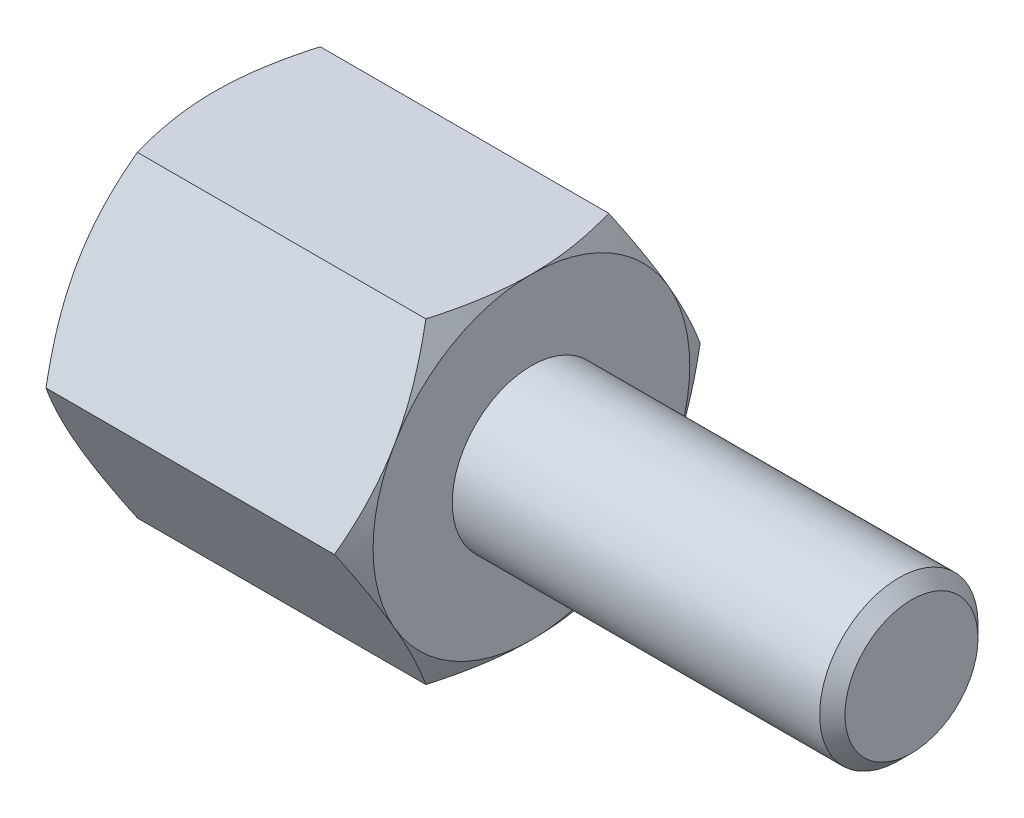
ISO-10303-21;
HEADER;
FILE_DESCRIPTION(('STEP AP214'),'2;1');
FILE_NAME('part.step','',(''),(''),'','','');
FILE_SCHEMA(('AUTOMOTIVE_DESIGN { 1 0 10303 214 1 1 1 1 }'));
ENDSEC;
DATA;
#1=APPLICATION_CONTEXT('core data for automotive mechanical design processes');
#2=APPLICATION_PROTOCOL_DEFINITION('international standard','automotive_design',2000,#1);
#3=PRODUCT_CONTEXT('',#1,'mechanical');
#4=PRODUCT('Part','Part','',(#3));
#5=PRODUCT_RELATED_PRODUCT_CATEGORY('part','',(#4));
#6=PRODUCT_DEFINITION_FORMATION('','',#4);
#7=PRODUCT_DEFINITION_CONTEXT('part definition',#1,'design');
#8=PRODUCT_DEFINITION('design','',#6,#7);
#9=PRODUCT_DEFINITION_SHAPE('','',#8);
#10=(LENGTH_UNIT() NAMED_UNIT(*) SI_UNIT(.MILLI.,.METRE.));
#11=(NAMED_UNIT(*) PLANE_ANGLE_UNIT() SI_UNIT($,.RADIAN.));
#12=(NAMED_UNIT(*) SI_UNIT($,.STERADIAN.) SOLID_ANGLE_UNIT());
#13=UNCERTAINTY_MEASURE_WITH_UNIT(LENGTH_MEASURE(1.E-05),#10,'distance_accuracy_value','');
#14=(GEOMETRIC_REPRESENTATION_CONTEXT(3) GLOBAL_UNCERTAINTY_ASSIGNED_CONTEXT((#13)) GLOBAL_UNIT_ASSIGNED_CONTEXT((#10,
#11,#12)) REPRESENTATION_CONTEXT('',''));
#15=CARTESIAN_POINT('',(0.,0.,0.));
#16=DIRECTION('',(0.,0.,1.));
#17=DIRECTION('',(1.,0.,0.));
#18=AXIS2_PLACEMENT_3D('',#15,#16,#17);
#19=CARTESIAN_POINT('',(2.5,2.5,-1.44337567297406));
#20=DIRECTION('',(1.,0.,0.));
#21=DIRECTION('',(0.,0.,-1.));
#22=AXIS2_PLACEMENT_3D('',#19,#20,#21);
#23=PLANE('',#22);
#24=CARTESIAN_POINT('',(2.5,0.,0.));
#25=DIRECTION('',(1.,0.,0.));
#26=DIRECTION('',(0.,0.,-1.));
#27=AXIS2_PLACEMENT_3D('',#24,#25,#26);
#28=CIRCLE('',#27,2.5);
#29=CARTESIAN_POINT('',(2.5,-1.25,-2.1650635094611));
#30=VERTEX_POINT('',#29);
#31=CARTESIAN_POINT('',(2.5,1.25,-2.1650635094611));
#32=VERTEX_POINT('',#31);
#33=EDGE_CURVE('E288',#30,#32,#28,.T.);
#34=ORIENTED_EDGE('',*,*,#33,.T.);
#35=CARTESIAN_POINT('',(2.5,2.5,0.));
#36=VERTEX_POINT('',#35);
#37=EDGE_CURVE('E53',#32,#36,#28,.T.);
#38=ORIENTED_EDGE('',*,*,#37,.T.);
#39=CARTESIAN_POINT('',(2.5,1.25,2.1650635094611));
#40=VERTEX_POINT('',#39);
#41=EDGE_CURVE('E296',#36,#40,#28,.T.);
#42=ORIENTED_EDGE('',*,*,#41,.T.);
#43=CARTESIAN_POINT('',(2.5,-1.25,2.1650635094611));
#44=VERTEX_POINT('',#43);
#45=EDGE_CURVE('E301',#40,#44,#28,.T.);
#46=ORIENTED_EDGE('',*,*,#45,.T.);
#47=CARTESIAN_POINT('',(2.5,0.,0.));
#48=DIRECTION('',(-1.,0.,0.));
#49=DIRECTION('',(0.,-1.,0.));
#50=AXIS2_PLACEMENT_3D('',#47,#48,#49);
#51=CIRCLE('',#50,2.5);
#52=CARTESIAN_POINT('',(2.5,-2.5,0.));
#53=VERTEX_POINT('',#52);
#54=EDGE_CURVE('E193',#53,#44,#51,.T.);
#55=ORIENTED_EDGE('',*,*,#54,.F.);
#56=EDGE_CURVE('E61',#53,#30,#28,.T.);
#57=ORIENTED_EDGE('',*,*,#56,.T.);
#58=EDGE_LOOP('',(#34,#38,#42,#46,#55,#57));
#59=FACE_BOUND('',#58,.T.);
#60=CARTESIAN_POINT('',(2.5,0.,0.));
#61=DIRECTION('',(1.,0.,0.));
#62=DIRECTION('',(0.,0.,-1.));
#63=AXIS2_PLACEMENT_3D('',#60,#61,#62);
#64=CIRCLE('',#63,1.25);
#65=CARTESIAN_POINT('',(2.5,0.,-1.25));
#66=VERTEX_POINT('',#65);
#67=EDGE_CURVE('E318',#66,#66,#64,.T.);
#68=ORIENTED_EDGE('',*,*,#67,.F.);
#69=EDGE_LOOP('',(#68));
#70=FACE_BOUND('',#69,.T.);
#71=ADVANCED_FACE('F37',(#59,#70),#23,.T.);
#72=CARTESIAN_POINT('',(2.5,0.,-2.88675134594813));
#73=DIRECTION('',(0.,-0.5,0.866025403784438));
#74=DIRECTION('',(0.,-0.866025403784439,-0.5));
#75=AXIS2_PLACEMENT_3D('',#72,#73,#74);
#76=PLANE('',#75);
#77=CARTESIAN_POINT('',(2.27664233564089,-0.000200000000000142,-2.88686681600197));
#78=CARTESIAN_POINT('',(2.31327837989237,0.109663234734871,-2.82343724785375));
#79=CARTESIAN_POINT('',(2.34659778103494,0.220474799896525,-2.75946016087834));
#80=CARTESIAN_POINT('',(2.40475771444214,0.444016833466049,-2.63039810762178));
#81=CARTESIAN_POINT('',(2.42957767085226,0.556751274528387,-2.5653108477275));
#82=CARTESIAN_POINT('',(2.46821434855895,0.780822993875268,-2.43594298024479));
#83=CARTESIAN_POINT('',(2.48228820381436,0.892125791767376,-2.37168227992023));
#84=CARTESIAN_POINT('',(2.49909084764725,1.11525522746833,-2.24285844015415));
#85=CARTESIAN_POINT('',(2.50183354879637,1.22708105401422,-2.17829576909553));
#86=CARTESIAN_POINT('',(2.49613423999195,1.43604197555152,-2.05765212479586));
#87=CARTESIAN_POINT('',(2.48909160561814,1.53320831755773,-2.0015531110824));
#88=CARTESIAN_POINT('',(2.46676858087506,1.726907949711,-1.88972057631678));
#89=CARTESIAN_POINT('',(2.45148056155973,1.82344056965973,-1.8339874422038));
#90=CARTESIAN_POINT('',(2.41326090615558,2.01753972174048,-1.7219242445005));
#91=CARTESIAN_POINT('',(2.39016722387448,2.11508168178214,-1.66560836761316));
#92=CARTESIAN_POINT('',(2.33775334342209,2.30871060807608,-1.55381665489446));
#93=CARTESIAN_POINT('',(2.30844546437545,2.40480005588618,-1.49833938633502));
#94=CARTESIAN_POINT('',(2.27664233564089,2.5002,-1.44326020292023));
#95=B_SPLINE_CURVE_WITH_KNOTS('',3,(#77,#78,#79,#80,#81,#82,#83,#84,#85,#86,#87,#88,#89,#90,#91,
#92,#93,#94),.UNSPECIFIED.,.F.,.F.,(4,2,2,2,2,2,2,2,4),(0.,0.396285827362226,0.79352433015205,
1.18093086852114,1.56786160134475,1.90479741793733,2.24204551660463,2.58677531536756,
2.93082800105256),.UNSPECIFIED.);
#96=CARTESIAN_POINT('',(2.2767090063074,0.,-2.88675134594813));
#97=VERTEX_POINT('',#96);
#98=EDGE_CURVE('E354',#97,#32,#95,.T.);
#99=ORIENTED_EDGE('',*,*,#98,.F.);
#100=DIRECTION('',(-1.,0.,0.));
#101=VECTOR('',#100,1.);
#102=CARTESIAN_POINT('',(2.5,0.,-2.88675134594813));
#103=LINE('',#102,#101);
#104=CARTESIAN_POINT('',(-2.2767090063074,0.,-2.88675134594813));
#105=VERTEX_POINT('',#104);
#106=EDGE_CURVE('E264',#97,#105,#103,.T.);
#107=ORIENTED_EDGE('',*,*,#106,.T.);
#108=CARTESIAN_POINT('',(-2.27664233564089,2.5002,-1.44326020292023));
#109=CARTESIAN_POINT('',(-2.31327837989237,2.39033676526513,-1.50668977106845));
#110=CARTESIAN_POINT('',(-2.34659778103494,2.27952520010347,-1.57066685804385));
#111=CARTESIAN_POINT('',(-2.40475771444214,2.05598316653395,-1.69972891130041));
#112=CARTESIAN_POINT('',(-2.42957767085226,1.94324872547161,-1.7648161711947));
#113=CARTESIAN_POINT('',(-2.46821434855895,1.71917700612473,-1.8941840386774));
#114=CARTESIAN_POINT('',(-2.48228820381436,1.60787420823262,-1.95844473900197));
#115=CARTESIAN_POINT('',(-2.49909084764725,1.38474477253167,-2.08726857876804));
#116=CARTESIAN_POINT('',(-2.50183354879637,1.27291894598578,-2.15183124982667));
#117=CARTESIAN_POINT('',(-2.49613423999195,1.06395802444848,-2.27247489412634));
#118=CARTESIAN_POINT('',(-2.48909160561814,0.966791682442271,-2.32857390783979));
#119=CARTESIAN_POINT('',(-2.46676858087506,0.773092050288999,-2.44040644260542));
#120=CARTESIAN_POINT('',(-2.45148056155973,0.676559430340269,-2.49613957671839));
#121=CARTESIAN_POINT('',(-2.41326090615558,0.482460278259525,-2.60820277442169));
#122=CARTESIAN_POINT('',(-2.39016722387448,0.38491831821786,-2.66451865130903));
#123=CARTESIAN_POINT('',(-2.33775334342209,0.191289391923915,-2.77631036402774));
#124=CARTESIAN_POINT('',(-2.30844546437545,0.0951999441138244,-2.83178763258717));
#125=CARTESIAN_POINT('',(-2.27664233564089,-0.000199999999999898,-2.88686681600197));
#126=B_SPLINE_CURVE_WITH_KNOTS('',3,(#108,#109,#110,#111,#112,#113,#114,#115,#116,#117,#118,
#119,#120,#121,#122,#123,#124,#125),.UNSPECIFIED.,.F.,.F.,(4,2,2,2,2,2,2,2,4),(0.,
0.396285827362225,0.793524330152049,1.18093086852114,1.56786160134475,1.90479741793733,
2.24204551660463,2.58677531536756,2.93082800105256),.UNSPECIFIED.);
#127=CARTESIAN_POINT('',(-2.5,1.25,-2.1650635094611));
#128=VERTEX_POINT('',#127);
#129=EDGE_CURVE('E382',#128,#105,#126,.T.);
#130=ORIENTED_EDGE('',*,*,#129,.F.);
#131=CARTESIAN_POINT('',(-2.2767090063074,2.5,-1.44337567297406));
#132=VERTEX_POINT('',#131);
#133=EDGE_CURVE('E380',#132,#128,#126,.T.);
#134=ORIENTED_EDGE('',*,*,#133,.F.);
#135=DIRECTION('',(-1.,0.,0.));
#136=VECTOR('',#135,1.);
#137=CARTESIAN_POINT('',(2.5,2.5,-1.44337567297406));
#138=LINE('',#137,#136);
#139=CARTESIAN_POINT('',(2.27670900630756,2.5,-1.44337567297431));
#140=VERTEX_POINT('',#139);
#141=EDGE_CURVE('E279',#140,#132,#138,.T.);
#142=ORIENTED_EDGE('',*,*,#141,.F.);
#143=EDGE_CURVE('E229',#32,#140,#95,.T.);
#144=ORIENTED_EDGE('',*,*,#143,.F.);
#145=EDGE_LOOP('',(#99,#107,#130,#134,#142,#144));
#146=FACE_BOUND('',#145,.T.);
#147=ADVANCED_FACE('F148',(#146),#76,.F.);
#148=CARTESIAN_POINT('',(2.5,2.5,-1.44337567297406));
#149=DIRECTION('',(0.,-1.,0.));
#150=DIRECTION('',(0.,0.,-1.));
#151=AXIS2_PLACEMENT_3D('',#148,#149,#150);
#152=PLANE('',#151);
#153=CARTESIAN_POINT('',(1.26803388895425,2.5,-3.90158441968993));
#154=CARTESIAN_POINT('',(1.32120772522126,2.5,-3.79217004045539));
#155=CARTESIAN_POINT('',(1.37387869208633,2.5,-3.68250707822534));
#156=CARTESIAN_POINT('',(1.47793249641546,2.5,-3.46255185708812));
#157=CARTESIAN_POINT('',(1.52931513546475,2.5,-3.35225950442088));
#158=CARTESIAN_POINT('',(1.63076309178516,2.5,-3.130356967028));
#159=CARTESIAN_POINT('',(1.68081992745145,2.5,-3.01874289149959));
#160=CARTESIAN_POINT('',(1.77891712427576,2.5,-2.79463535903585));
#161=CARTESIAN_POINT('',(1.82695757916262,2.5,-2.68214194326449));
#162=CARTESIAN_POINT('',(1.92201845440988,2.5,-2.45240385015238));
#163=CARTESIAN_POINT('',(1.96895431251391,2.5,-2.33512399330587));
#164=CARTESIAN_POINT('',(2.05933269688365,2.5,-2.09920133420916));
#165=CARTESIAN_POINT('',(2.10277483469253,2.5,-1.98055838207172));
#166=CARTESIAN_POINT('',(2.18504351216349,2.5,-1.74193489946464));
#167=CARTESIAN_POINT('',(2.22387917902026,2.5,-1.6219575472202));
#168=CARTESIAN_POINT('',(2.29570507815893,2.5,-1.38028205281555));
#169=CARTESIAN_POINT('',(2.32869712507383,2.5,-1.25858445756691));
#170=CARTESIAN_POINT('',(2.38709594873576,2.5,-1.01406369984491));
#171=CARTESIAN_POINT('',(2.4125437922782,2.5,-0.891250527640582));
#172=CARTESIAN_POINT('',(2.45442751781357,2.5,-0.644071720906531));
#173=CARTESIAN_POINT('',(2.47086432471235,2.5,-0.519706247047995));
#174=CARTESIAN_POINT('',(2.4932006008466,2.5,-0.27167920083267));
#175=CARTESIAN_POINT('',(2.49923751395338,2.5,-0.148030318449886));
#176=CARTESIAN_POINT('',(2.50062561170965,2.5,0.0993395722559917));
#177=CARTESIAN_POINT('',(2.49597656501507,2.5,0.223060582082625));
#178=CARTESIAN_POINT('',(2.47940443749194,2.5,0.4323517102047));
#179=CARTESIAN_POINT('',(2.47010665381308,2.5,0.518143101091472));
#180=CARTESIAN_POINT('',(2.44693847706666,2.5,0.689112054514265));
#181=CARTESIAN_POINT('',(2.43306748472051,2.5,0.774289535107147));
#182=CARTESIAN_POINT('',(2.38532020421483,2.5,1.02876599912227));
#183=CARTESIAN_POINT('',(2.34531764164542,2.5,1.19691958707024));
#184=CARTESIAN_POINT('',(2.25226567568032,2.5,1.53362893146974));
#185=CARTESIAN_POINT('',(2.19893620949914,2.5,1.70210423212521));
#186=CARTESIAN_POINT('',(2.11237169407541,2.5,1.95247339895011));
#187=CARTESIAN_POINT('',(2.08242477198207,2.5,2.03553184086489));
#188=CARTESIAN_POINT('',(2.02068409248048,2.5,2.20095860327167));
#189=CARTESIAN_POINT('',(1.98889037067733,2.5,2.2833269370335));
#190=CARTESIAN_POINT('',(1.90401426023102,2.5,2.49723312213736));
#191=CARTESIAN_POINT('',(1.84971733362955,2.5,2.6282879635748));
#192=CARTESIAN_POINT('',(1.73812739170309,2.5,2.88912034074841));
#193=CARTESIAN_POINT('',(1.6808341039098,2.5,3.01889775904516));
#194=CARTESIAN_POINT('',(1.56393487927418,2.5,3.27745045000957));
#195=CARTESIAN_POINT('',(1.50432825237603,2.5,3.40622540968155));
#196=CARTESIAN_POINT('',(1.38332345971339,2.5,3.66293235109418));
#197=CARTESIAN_POINT('',(1.32192524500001,2.5,3.79086430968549));
#198=CARTESIAN_POINT('',(1.1354580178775,2.5,4.17399495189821));
#199=CARTESIAN_POINT('',(1.00828249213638,2.5,4.42816724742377));
#200=CARTESIAN_POINT('',(0.750345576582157,2.5,4.93461464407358));
#201=CARTESIAN_POINT('',(0.619584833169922,2.5,5.18689007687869));
#202=CARTESIAN_POINT('',(0.368710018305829,2.5,5.66512451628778));
#203=CARTESIAN_POINT('',(0.248829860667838,2.5,5.89120644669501));
#204=CARTESIAN_POINT('',(0.00759021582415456,2.5,6.34259369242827));
#205=CARTESIAN_POINT('',(-0.113769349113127,2.5,6.56789896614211));
#206=CARTESIAN_POINT('',(-0.357219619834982,2.5,7.01722044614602));
#207=CARTESIAN_POINT('',(-0.479306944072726,2.5,7.24123848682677));
#208=CARTESIAN_POINT('',(-0.724333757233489,2.5,7.68878772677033));
#209=CARTESIAN_POINT('',(-0.847273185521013,2.5,7.9123189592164));
#210=CARTESIAN_POINT('',(-0.970524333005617,2.5,8.13567697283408));
#211=B_SPLINE_CURVE_WITH_KNOTS('',3,(#153,#154,#155,#156,#157,#158,#159,#160,#161,#162,#163,
#164,#165,#166,#167,#168,#169,#170,#171,#172,#173,#174,#175,#176,#177,#178,#179,#180,#181,#182,
#183,#184,#185,#186,#187,#188,#189,#190,#191,#192,#193,#194,#195,#196,#197,#198,#199,#200,#201,
#202,#203,#204,#205,#206,#207,#208,#209,#210),.UNSPECIFIED.,.F.,.F.,(4,2,2,2,2,2,2,2,2,2,2,2,2,
2,2,2,2,2,2,2,2,2,2,2,2,2,2,2,4),(0.,0.364957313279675,0.729970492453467,1.09692930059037,
1.46387103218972,1.84279746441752,2.22176597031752,2.59997058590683,2.97805755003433,
3.35404692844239,3.72999770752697,4.10094071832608,4.47189175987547,4.73064905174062,
4.98944026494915,5.50729076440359,6.03710483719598,6.30196454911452,6.56681915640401,
6.99233818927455,7.41789598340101,7.84358170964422,8.26927907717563,9.12186602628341,
9.97430025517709,10.7419897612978,11.5097197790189,12.2750964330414,13.0404191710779),.UNSPECIFIED.);
#212=EDGE_CURVE('E227',#140,#36,#211,.T.);
#213=ORIENTED_EDGE('',*,*,#212,.F.);
#214=ORIENTED_EDGE('',*,*,#141,.T.);
#215=CARTESIAN_POINT('',(-1.26803388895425,2.5,-3.90158441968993));
#216=CARTESIAN_POINT('',(-1.32120772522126,2.5,-3.79217004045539));
#217=CARTESIAN_POINT('',(-1.37387869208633,2.5,-3.68250707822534));
#218=CARTESIAN_POINT('',(-1.47793249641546,2.5,-3.46255185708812));
#219=CARTESIAN_POINT('',(-1.52931513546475,2.5,-3.35225950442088));
#220=CARTESIAN_POINT('',(-1.63076309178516,2.5,-3.130356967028));
#221=CARTESIAN_POINT('',(-1.68081992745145,2.5,-3.01874289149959));
#222=CARTESIAN_POINT('',(-1.77891712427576,2.5,-2.79463535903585));
#223=CARTESIAN_POINT('',(-1.82695757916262,2.5,-2.68214194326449));
#224=CARTESIAN_POINT('',(-1.92201845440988,2.5,-2.45240385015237));
#225=CARTESIAN_POINT('',(-1.96895431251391,2.5,-2.33512399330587));
#226=CARTESIAN_POINT('',(-2.05933269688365,2.5,-2.09920133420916));
#227=CARTESIAN_POINT('',(-2.10277483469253,2.5,-1.98055838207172));
#228=CARTESIAN_POINT('',(-2.18504351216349,2.5,-1.74193489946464));
#229=CARTESIAN_POINT('',(-2.22387917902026,2.5,-1.6219575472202));
#230=CARTESIAN_POINT('',(-2.29570507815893,2.5,-1.38028205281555));
#231=CARTESIAN_POINT('',(-2.32869712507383,2.5,-1.25858445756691));
#232=CARTESIAN_POINT('',(-2.38709594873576,2.5,-1.01406369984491));
#233=CARTESIAN_POINT('',(-2.4125437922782,2.5,-0.891250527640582));
#234=CARTESIAN_POINT('',(-2.45442751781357,2.5,-0.644071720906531));
#235=CARTESIAN_POINT('',(-2.47086432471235,2.5,-0.519706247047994));
#236=CARTESIAN_POINT('',(-2.4932006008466,2.5,-0.27167920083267));
#237=CARTESIAN_POINT('',(-2.49923751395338,2.5,-0.148030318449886));
#238=CARTESIAN_POINT('',(-2.50062561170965,2.5,0.099339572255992));
#239=CARTESIAN_POINT('',(-2.49597656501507,2.5,0.223060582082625));
#240=CARTESIAN_POINT('',(-2.47940443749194,2.5,0.4323517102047));
#241=CARTESIAN_POINT('',(-2.47010665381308,2.5,0.518143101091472));
#242=CARTESIAN_POINT('',(-2.44693847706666,2.5,0.689112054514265));
#243=CARTESIAN_POINT('',(-2.43306748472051,2.5,0.774289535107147));
#244=CARTESIAN_POINT('',(-2.38532020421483,2.5,1.02876599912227));
#245=CARTESIAN_POINT('',(-2.34531764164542,2.5,1.19691958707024));
#246=CARTESIAN_POINT('',(-2.25226567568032,2.5,1.53362893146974));
#247=CARTESIAN_POINT('',(-2.19893620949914,2.5,1.70210423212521));
#248=CARTESIAN_POINT('',(-2.11237169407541,2.5,1.95247339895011));
#249=CARTESIAN_POINT('',(-2.08242477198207,2.5,2.03553184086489));
#250=CARTESIAN_POINT('',(-2.02068409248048,2.5,2.20095860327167));
#251=CARTESIAN_POINT('',(-1.98889037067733,2.5,2.2833269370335));
#252=CARTESIAN_POINT('',(-1.90401426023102,2.5,2.49723312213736));
#253=CARTESIAN_POINT('',(-1.84971733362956,2.5,2.6282879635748));
#254=CARTESIAN_POINT('',(-1.7381273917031,2.5,2.8891203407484));
#255=CARTESIAN_POINT('',(-1.6808341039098,2.5,3.01889775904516));
#256=CARTESIAN_POINT('',(-1.56393487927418,2.5,3.27745045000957));
#257=CARTESIAN_POINT('',(-1.50432825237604,2.5,3.40622540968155));
#258=CARTESIAN_POINT('',(-1.3833234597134,2.5,3.66293235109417));
#259=CARTESIAN_POINT('',(-1.32192524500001,2.5,3.79086430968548));
#260=CARTESIAN_POINT('',(-1.1354580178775,2.5,4.1739949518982));
#261=CARTESIAN_POINT('',(-1.00828249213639,2.5,4.42816724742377));
#262=CARTESIAN_POINT('',(-0.75034557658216,2.5,4.93461464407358));
#263=CARTESIAN_POINT('',(-0.619584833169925,2.5,5.18689007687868));
#264=CARTESIAN_POINT('',(-0.368710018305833,2.5,5.66512451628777));
#265=CARTESIAN_POINT('',(-0.248829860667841,2.5,5.891206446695));
#266=CARTESIAN_POINT('',(-0.00759021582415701,2.5,6.34259369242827));
#267=CARTESIAN_POINT('',(0.113769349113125,2.5,6.5678989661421));
#268=CARTESIAN_POINT('',(0.357219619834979,2.5,7.01722044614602));
#269=CARTESIAN_POINT('',(0.479306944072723,2.5,7.24123848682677));
#270=CARTESIAN_POINT('',(0.724333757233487,2.5,7.68878772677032));
#271=CARTESIAN_POINT('',(0.847273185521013,2.5,7.9123189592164));
#272=CARTESIAN_POINT('',(0.970524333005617,2.5,8.13567697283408));
#273=B_SPLINE_CURVE_WITH_KNOTS('',3,(#215,#216,#217,#218,#219,#220,#221,#222,#223,#224,#225,
#226,#227,#228,#229,#230,#231,#232,#233,#234,#235,#236,#237,#238,#239,#240,#241,#242,#243,#244,
#245,#246,#247,#248,#249,#250,#251,#252,#253,#254,#255,#256,#257,#258,#259,#260,#261,#262,#263,
#264,#265,#266,#267,#268,#269,#270,#271,#272),.UNSPECIFIED.,.F.,.F.,(4,2,2,2,2,2,2,2,2,2,2,2,2,
2,2,2,2,2,2,2,2,2,2,2,2,2,2,2,4),(0.,0.364957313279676,0.729970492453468,1.09692930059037,
1.46387103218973,1.84279746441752,2.22176597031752,2.59997058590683,2.97805755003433,
3.35404692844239,3.72999770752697,4.10094071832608,4.47189175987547,4.73064905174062,
4.98944026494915,5.5072907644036,6.03710483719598,6.30196454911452,6.56681915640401,
6.99233818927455,7.41789598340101,7.84358170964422,8.26927907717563,9.12186602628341,
9.97430025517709,10.7419897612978,11.5097197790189,12.2750964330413,13.0404191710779),.UNSPECIFIED.);
#274=CARTESIAN_POINT('',(-2.5,2.5,0.));
#275=VERTEX_POINT('',#274);
#276=EDGE_CURVE('E241',#275,#132,#273,.F.);
#277=ORIENTED_EDGE('',*,*,#276,.F.);
#278=CARTESIAN_POINT('',(-2.2767090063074,2.5,1.44337567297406));
#279=VERTEX_POINT('',#278);
#280=EDGE_CURVE('E249',#279,#275,#273,.F.);
#281=ORIENTED_EDGE('',*,*,#280,.F.);
#282=DIRECTION('',(-1.,0.,0.));
#283=VECTOR('',#282,1.);
#284=CARTESIAN_POINT('',(2.5,2.5,1.44337567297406));
#285=LINE('',#284,#283);
#286=CARTESIAN_POINT('',(2.2767090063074,2.5,1.44337567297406));
#287=VERTEX_POINT('',#286);
#288=EDGE_CURVE('E276',#287,#279,#285,.T.);
#289=ORIENTED_EDGE('',*,*,#288,.F.);
#290=EDGE_CURVE('E221',#36,#287,#211,.T.);
#291=ORIENTED_EDGE('',*,*,#290,.F.);
#292=EDGE_LOOP('',(#213,#214,#277,#281,#289,#291));
#293=FACE_BOUND('',#292,.T.);
#294=ADVANCED_FACE('F153',(#293),#152,.F.);
#295=CARTESIAN_POINT('',(2.5,2.5,1.44337567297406));
#296=DIRECTION('',(0.,-0.5,-0.866025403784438));
#297=DIRECTION('',(0.,0.866025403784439,-0.5));
#298=AXIS2_PLACEMENT_3D('',#295,#296,#297);
#299=PLANE('',#298);
#300=CARTESIAN_POINT('',(2.27664233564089,2.5002,1.44326020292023));
#301=CARTESIAN_POINT('',(2.31327837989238,2.39033676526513,1.50668977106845));
#302=CARTESIAN_POINT('',(2.34659778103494,2.27952520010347,1.57066685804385));
#303=CARTESIAN_POINT('',(2.40475771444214,2.05598316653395,1.69972891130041));
#304=CARTESIAN_POINT('',(2.42957767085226,1.94324872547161,1.7648161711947));
#305=CARTESIAN_POINT('',(2.46821434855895,1.71917700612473,1.8941840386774));
#306=CARTESIAN_POINT('',(2.48228820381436,1.60787420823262,1.95844473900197));
#307=CARTESIAN_POINT('',(2.49909084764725,1.38474477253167,2.08726857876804));
#308=CARTESIAN_POINT('',(2.50183354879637,1.27291894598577,2.15183124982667));
#309=CARTESIAN_POINT('',(2.49613423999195,1.06395802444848,2.27247489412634));
#310=CARTESIAN_POINT('',(2.48909160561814,0.96679168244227,2.32857390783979));
#311=CARTESIAN_POINT('',(2.46676858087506,0.773092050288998,2.44040644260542));
#312=CARTESIAN_POINT('',(2.45148056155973,0.676559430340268,2.49613957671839));
#313=CARTESIAN_POINT('',(2.41326090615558,0.482460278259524,2.60820277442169));
#314=CARTESIAN_POINT('',(2.39016722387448,0.38491831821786,2.66451865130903));
#315=CARTESIAN_POINT('',(2.33775334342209,0.191289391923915,2.77631036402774));
#316=CARTESIAN_POINT('',(2.30844546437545,0.0951999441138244,2.83178763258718));
#317=CARTESIAN_POINT('',(2.27664233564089,-0.000199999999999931,2.88686681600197));
#318=B_SPLINE_CURVE_WITH_KNOTS('',3,(#300,#301,#302,#303,#304,#305,#306,#307,#308,#309,#310,
#311,#312,#313,#314,#315,#316,#317),.UNSPECIFIED.,.F.,.F.,(4,2,2,2,2,2,2,2,4),(0.,
0.396285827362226,0.793524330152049,1.18093086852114,1.56786160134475,1.90479741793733,
2.24204551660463,2.58677531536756,2.93082800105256),.UNSPECIFIED.);
#319=EDGE_CURVE('E228',#287,#40,#318,.T.);
#320=ORIENTED_EDGE('',*,*,#319,.F.);
#321=ORIENTED_EDGE('',*,*,#288,.T.);
#322=CARTESIAN_POINT('',(-2.27664233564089,-0.000199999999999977,2.88686681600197));
#323=CARTESIAN_POINT('',(-2.31327837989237,0.109663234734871,2.82343724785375));
#324=CARTESIAN_POINT('',(-2.34659778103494,0.220474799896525,2.75946016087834));
#325=CARTESIAN_POINT('',(-2.40475771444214,0.444016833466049,2.63039810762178));
#326=CARTESIAN_POINT('',(-2.42957767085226,0.556751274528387,2.5653108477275));
#327=CARTESIAN_POINT('',(-2.46821434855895,0.780822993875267,2.43594298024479));
#328=CARTESIAN_POINT('',(-2.48228820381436,0.892125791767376,2.37168227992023));
#329=CARTESIAN_POINT('',(-2.49909084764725,1.11525522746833,2.24285844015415));
#330=CARTESIAN_POINT('',(-2.50183354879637,1.22708105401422,2.17829576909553));
#331=CARTESIAN_POINT('',(-2.49613423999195,1.43604197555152,2.05765212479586));
#332=CARTESIAN_POINT('',(-2.48909160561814,1.53320831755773,2.0015531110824));
#333=CARTESIAN_POINT('',(-2.46676858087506,1.726907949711,1.88972057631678));
#334=CARTESIAN_POINT('',(-2.45148056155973,1.82344056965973,1.8339874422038));
#335=CARTESIAN_POINT('',(-2.41326090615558,2.01753972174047,1.7219242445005));
#336=CARTESIAN_POINT('',(-2.39016722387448,2.11508168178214,1.66560836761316));
#337=CARTESIAN_POINT('',(-2.33775334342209,2.30871060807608,1.55381665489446));
#338=CARTESIAN_POINT('',(-2.30844546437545,2.40480005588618,1.49833938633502));
#339=CARTESIAN_POINT('',(-2.27664233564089,2.5002,1.44326020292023));
#340=B_SPLINE_CURVE_WITH_KNOTS('',3,(#322,#323,#324,#325,#326,#327,#328,#329,#330,#331,#332,
#333,#334,#335,#336,#337,#338,#339),.UNSPECIFIED.,.F.,.F.,(4,2,2,2,2,2,2,2,4),(0.,
0.396285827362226,0.793524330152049,1.18093086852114,1.56786160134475,1.90479741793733,
2.24204551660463,2.58677531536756,2.93082800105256),.UNSPECIFIED.);
#341=CARTESIAN_POINT('',(-2.5,1.25,2.1650635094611));
#342=VERTEX_POINT('',#341);
#343=EDGE_CURVE('E255',#342,#279,#340,.T.);
#344=ORIENTED_EDGE('',*,*,#343,.F.);
#345=CARTESIAN_POINT('',(-2.2767090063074,0.,2.88675134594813));
#346=VERTEX_POINT('',#345);
#347=EDGE_CURVE('E262',#346,#342,#340,.T.);
#348=ORIENTED_EDGE('',*,*,#347,.F.);
#349=DIRECTION('',(-1.,0.,0.));
#350=VECTOR('',#349,1.);
#351=CARTESIAN_POINT('',(2.5,0.,2.88675134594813));
#352=LINE('',#351,#350);
#353=CARTESIAN_POINT('',(2.2767090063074,0.,2.88675134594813));
#354=VERTEX_POINT('',#353);
#355=EDGE_CURVE('E273',#354,#346,#352,.T.);
#356=ORIENTED_EDGE('',*,*,#355,.F.);
#357=EDGE_CURVE('E215',#40,#354,#318,.T.);
#358=ORIENTED_EDGE('',*,*,#357,.F.);
#359=EDGE_LOOP('',(#320,#321,#344,#348,#356,#358));
#360=FACE_BOUND('',#359,.T.);
#361=ADVANCED_FACE('F235',(#360),#299,.F.);
#362=CARTESIAN_POINT('',(2.5,0.,2.88675134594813));
#363=DIRECTION('',(0.,0.5,-0.866025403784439));
#364=DIRECTION('',(0.,0.866025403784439,0.5));
#365=AXIS2_PLACEMENT_3D('',#362,#363,#364);
#366=PLANE('',#365);
#367=CARTESIAN_POINT('',(2.27664233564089,0.00020000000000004,2.88686681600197));
#368=CARTESIAN_POINT('',(2.31327837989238,-0.109663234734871,2.82343724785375));
#369=CARTESIAN_POINT('',(2.34659778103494,-0.220474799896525,2.75946016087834));
#370=CARTESIAN_POINT('',(2.40475771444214,-0.444016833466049,2.63039810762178));
#371=CARTESIAN_POINT('',(2.42957767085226,-0.556751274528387,2.5653108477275));
#372=CARTESIAN_POINT('',(2.46821434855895,-0.780822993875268,2.43594298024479));
#373=CARTESIAN_POINT('',(2.48228820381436,-0.892125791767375,2.37168227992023));
#374=CARTESIAN_POINT('',(2.49909084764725,-1.11525522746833,2.24285844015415));
#375=CARTESIAN_POINT('',(2.50183354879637,-1.22708105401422,2.17829576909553));
#376=CARTESIAN_POINT('',(2.49613423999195,-1.43604197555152,2.05765212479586));
#377=CARTESIAN_POINT('',(2.48909160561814,-1.53320831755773,2.0015531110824));
#378=CARTESIAN_POINT('',(2.46676858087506,-1.726907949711,1.88972057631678));
#379=CARTESIAN_POINT('',(2.45148056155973,-1.82344056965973,1.8339874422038));
#380=CARTESIAN_POINT('',(2.41326090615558,-2.01753972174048,1.7219242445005));
#381=CARTESIAN_POINT('',(2.39016722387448,-2.11508168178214,1.66560836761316));
#382=CARTESIAN_POINT('',(2.33775334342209,-2.30871060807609,1.55381665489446));
#383=CARTESIAN_POINT('',(2.30844546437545,-2.40480005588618,1.49833938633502));
#384=CARTESIAN_POINT('',(2.27664233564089,-2.5002,1.44326020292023));
#385=B_SPLINE_CURVE_WITH_KNOTS('',3,(#367,#368,#369,#370,#371,#372,#373,#374,#375,#376,#377,
#378,#379,#380,#381,#382,#383,#384),.UNSPECIFIED.,.F.,.F.,(4,2,2,2,2,2,2,2,4),(0.,
0.396285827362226,0.793524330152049,1.18093086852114,1.56786160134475,1.90479741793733,
2.24204551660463,2.58677531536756,2.93082800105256),.UNSPECIFIED.);
#386=EDGE_CURVE('E317',#354,#44,#385,.T.);
#387=ORIENTED_EDGE('',*,*,#386,.F.);
#388=ORIENTED_EDGE('',*,*,#355,.T.);
#389=CARTESIAN_POINT('',(-2.27664233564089,-2.5002,1.44326020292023));
#390=CARTESIAN_POINT('',(-2.31327837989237,-2.39033676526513,1.50668977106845));
#391=CARTESIAN_POINT('',(-2.34659778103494,-2.27952520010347,1.57066685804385));
#392=CARTESIAN_POINT('',(-2.40475771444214,-2.05598316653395,1.69972891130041));
#393=CARTESIAN_POINT('',(-2.42957767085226,-1.94324872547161,1.7648161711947));
#394=CARTESIAN_POINT('',(-2.46821434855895,-1.71917700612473,1.8941840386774));
#395=CARTESIAN_POINT('',(-2.48228820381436,-1.60787420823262,1.95844473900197));
#396=CARTESIAN_POINT('',(-2.49909084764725,-1.38474477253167,2.08726857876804));
#397=CARTESIAN_POINT('',(-2.50183354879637,-1.27291894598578,2.15183124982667));
#398=CARTESIAN_POINT('',(-2.49613423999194,-1.06395802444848,2.27247489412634));
#399=CARTESIAN_POINT('',(-2.48909160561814,-0.96679168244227,2.32857390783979));
#400=CARTESIAN_POINT('',(-2.46676858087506,-0.773092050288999,2.44040644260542));
#401=CARTESIAN_POINT('',(-2.45148056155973,-0.676559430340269,2.49613957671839));
#402=CARTESIAN_POINT('',(-2.41326090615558,-0.482460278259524,2.60820277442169));
#403=CARTESIAN_POINT('',(-2.39016722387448,-0.38491831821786,2.66451865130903));
#404=CARTESIAN_POINT('',(-2.33775334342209,-0.191289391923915,2.77631036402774));
#405=CARTESIAN_POINT('',(-2.30844546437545,-0.0951999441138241,2.83178763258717));
#406=CARTESIAN_POINT('',(-2.27664233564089,0.000200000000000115,2.88686681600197));
#407=B_SPLINE_CURVE_WITH_KNOTS('',3,(#389,#390,#391,#392,#393,#394,#395,#396,#397,#398,#399,
#400,#401,#402,#403,#404,#405,#406),.UNSPECIFIED.,.F.,.F.,(4,2,2,2,2,2,2,2,4),(0.,
0.396285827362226,0.793524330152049,1.18093086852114,1.56786160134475,1.90479741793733,
2.24204551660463,2.58677531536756,2.93082800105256),.UNSPECIFIED.);
#408=CARTESIAN_POINT('',(-2.5,-1.25,2.1650635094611));
#409=VERTEX_POINT('',#408);
#410=EDGE_CURVE('E263',#409,#346,#407,.T.);
#411=ORIENTED_EDGE('',*,*,#410,.F.);
#412=CARTESIAN_POINT('',(-2.2767090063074,-2.5,1.44337567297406));
#413=VERTEX_POINT('',#412);
#414=EDGE_CURVE('E250',#413,#409,#407,.T.);
#415=ORIENTED_EDGE('',*,*,#414,.F.);
#416=DIRECTION('',(-1.,0.,0.));
#417=VECTOR('',#416,1.);
#418=CARTESIAN_POINT('',(2.5,-2.5,1.44337567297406));
#419=LINE('',#418,#417);
#420=CARTESIAN_POINT('',(2.2767090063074,-2.5,1.44337567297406));
#421=VERTEX_POINT('',#420);
#422=EDGE_CURVE('E270',#421,#413,#419,.T.);
#423=ORIENTED_EDGE('',*,*,#422,.F.);
#424=EDGE_CURVE('E210',#44,#421,#385,.T.);
#425=ORIENTED_EDGE('',*,*,#424,.F.);
#426=EDGE_LOOP('',(#387,#388,#411,#415,#423,#425));
#427=FACE_BOUND('',#426,.T.);
#428=ADVANCED_FACE('F413',(#427),#366,.F.);
#429=CARTESIAN_POINT('',(2.5,-2.5,1.44337567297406));
#430=DIRECTION('',(0.,1.,0.));
#431=DIRECTION('',(0.,0.,1.));
#432=AXIS2_PLACEMENT_3D('',#429,#430,#431);
#433=PLANE('',#432);
#434=CARTESIAN_POINT('',(1.26803388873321,-2.5,-3.90158442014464));
#435=CARTESIAN_POINT('',(1.32120772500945,-2.5,-3.7921700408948));
#436=CARTESIAN_POINT('',(1.37387869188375,-2.5,-3.68250707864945));
#437=CARTESIAN_POINT('',(1.47793249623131,-2.5,-3.46255185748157));
#438=CARTESIAN_POINT('',(1.52931513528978,-2.5,-3.35225950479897));
#439=CARTESIAN_POINT('',(1.63076309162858,-2.5,-3.13035696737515));
#440=CARTESIAN_POINT('',(1.68081992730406,-2.5,-3.01874289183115));
#441=CARTESIAN_POINT('',(1.7789171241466,-2.5,-2.79463535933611));
#442=CARTESIAN_POINT('',(1.8269575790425,-2.5,-2.68214194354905));
#443=CARTESIAN_POINT('',(1.92201845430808,-2.5,-2.45240385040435));
#444=CARTESIAN_POINT('',(1.96895431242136,-2.5,-2.33512399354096));
#445=CARTESIAN_POINT('',(2.05933269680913,-2.5,-2.09920133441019));
#446=CARTESIAN_POINT('',(2.10277483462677,-2.5,-1.98055838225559));
#447=CARTESIAN_POINT('',(2.18504351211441,-2.5,-1.74193489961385));
#448=CARTESIAN_POINT('',(2.2238791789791,-2.5,-1.62195754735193));
#449=CARTESIAN_POINT('',(2.29570507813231,-2.5,-1.38028205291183));
#450=CARTESIAN_POINT('',(2.32869712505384,-2.5,-1.25858445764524));
#451=CARTESIAN_POINT('',(2.38709594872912,-2.5,-1.01406369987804));
#452=CARTESIAN_POINT('',(2.41254379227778,-2.5,-0.891250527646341));
#453=CARTESIAN_POINT('',(2.45442751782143,-2.5,-0.644071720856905));
#454=CARTESIAN_POINT('',(2.47086432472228,-2.5,-0.519706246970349));
#455=CARTESIAN_POINT('',(2.49320060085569,-2.5,-0.271679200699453));
#456=CARTESIAN_POINT('',(2.49923751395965,-2.5,-0.148030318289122));
#457=CARTESIAN_POINT('',(2.50062561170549,-2.5,0.0993395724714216));
#458=CARTESIAN_POINT('',(2.49597656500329,-2.5,0.223060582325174));
#459=CARTESIAN_POINT('',(2.47940443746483,-2.5,0.432351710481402));
#460=CARTESIAN_POINT('',(2.47010665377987,-2.5,0.518143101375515));
#461=CARTESIAN_POINT('',(2.44693847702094,-2.5,0.689112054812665));
#462=CARTESIAN_POINT('',(2.43306748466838,-2.5,0.774289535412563));
#463=CARTESIAN_POINT('',(2.3853202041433,-2.5,1.02876599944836));
#464=CARTESIAN_POINT('',(2.34531764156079,-2.5,1.19691958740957));
#465=CARTESIAN_POINT('',(2.25226567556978,-2.5,1.53362893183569));
#466=CARTESIAN_POINT('',(2.19893620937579,-2.5,1.70210423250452));
#467=CARTESIAN_POINT('',(2.1123716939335,-2.5,1.95247339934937));
#468=CARTESIAN_POINT('',(2.08242477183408,-2.5,2.03553184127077));
#469=CARTESIAN_POINT('',(2.02068409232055,-2.5,2.2009586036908));
#470=CARTESIAN_POINT('',(1.98889037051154,-2.5,2.28332693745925));
#471=CARTESIAN_POINT('',(1.90401426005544,-2.5,2.49723312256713));
#472=CARTESIAN_POINT('',(1.84971733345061,-2.5,2.62828796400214));
#473=CARTESIAN_POINT('',(1.73812739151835,-2.5,2.88912034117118));
#474=CARTESIAN_POINT('',(1.68083410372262,-2.5,3.01889775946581));
#475=CARTESIAN_POINT('',(1.56393487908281,-2.5,3.27745045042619));
#476=CARTESIAN_POINT('',(1.50432825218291,-2.5,3.40622541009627));
#477=CARTESIAN_POINT('',(1.38332345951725,-2.5,3.66293235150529));
#478=CARTESIAN_POINT('',(1.32192524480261,-2.5,3.7908643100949));
#479=CARTESIAN_POINT('',(1.13545801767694,-2.5,4.17399495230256));
#480=CARTESIAN_POINT('',(1.00828249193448,-2.5,4.428167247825));
#481=CARTESIAN_POINT('',(0.750345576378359,-2.5,4.93461464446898));
#482=CARTESIAN_POINT('',(0.619584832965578,-2.5,5.18689007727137));
#483=CARTESIAN_POINT('',(0.368710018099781,-2.5,5.66512451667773));
#484=CARTESIAN_POINT('',(0.248829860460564,-2.5,5.8912064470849));
#485=CARTESIAN_POINT('',(0.00759021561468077,-2.5,6.34259369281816));
#486=CARTESIAN_POINT('',(-0.113769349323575,-2.5,6.56789896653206));
#487=CARTESIAN_POINT('',(-0.357219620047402,-2.5,7.01722044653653));
#488=CARTESIAN_POINT('',(-0.479306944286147,-2.5,7.24123848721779));
#489=CARTESIAN_POINT('',(-0.724333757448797,-2.5,7.68878772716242));
#490=CARTESIAN_POINT('',(-0.847273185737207,-2.5,7.91231895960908));
#491=CARTESIAN_POINT('',(-0.970524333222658,-2.5,8.13567697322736));
#492=B_SPLINE_CURVE_WITH_KNOTS('',3,(#434,#435,#436,#437,#438,#439,#440,#441,#442,#443,#444,
#445,#446,#447,#448,#449,#450,#451,#452,#453,#454,#455,#456,#457,#458,#459,#460,#461,#462,#463,
#464,#465,#466,#467,#468,#469,#470,#471,#472,#473,#474,#475,#476,#477,#478,#479,#480,#481,#482,
#483,#484,#485,#486,#487,#488,#489,#490,#491),.UNSPECIFIED.,.F.,.F.,(4,2,2,2,2,2,2,2,2,2,2,2,2,
2,2,2,2,2,2,2,2,2,2,2,2,2,2,2,4),(0.,0.364957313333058,0.729970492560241,1.09692930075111,
1.46387103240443,1.84279746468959,2.22176597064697,2.59997058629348,2.97805755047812,
3.35404692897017,3.72999770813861,4.10094071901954,4.47189176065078,4.73064905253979,
4.98944026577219,5.50729076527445,6.03710483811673,6.30196455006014,6.56681915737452,
6.99233819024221,7.4178959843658,7.84358171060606,8.2692790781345,9.12186602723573,
9.97430025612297,10.7419897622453,11.5097197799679,12.2750964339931,13.0404191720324),.UNSPECIFIED.);
#493=EDGE_CURVE('E338',#421,#53,#492,.F.);
#494=ORIENTED_EDGE('',*,*,#493,.F.);
#495=ORIENTED_EDGE('',*,*,#422,.T.);
#496=CARTESIAN_POINT('',(-1.26803388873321,-2.5,-3.90158442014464));
#497=CARTESIAN_POINT('',(-1.32120772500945,-2.5,-3.7921700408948));
#498=CARTESIAN_POINT('',(-1.37387869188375,-2.5,-3.68250707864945));
#499=CARTESIAN_POINT('',(-1.47793249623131,-2.5,-3.46255185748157));
#500=CARTESIAN_POINT('',(-1.52931513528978,-2.5,-3.35225950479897));
#501=CARTESIAN_POINT('',(-1.63076309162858,-2.5,-3.13035696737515));
#502=CARTESIAN_POINT('',(-1.68081992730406,-2.5,-3.01874289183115));
#503=CARTESIAN_POINT('',(-1.7789171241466,-2.5,-2.79463535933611));
#504=CARTESIAN_POINT('',(-1.8269575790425,-2.5,-2.68214194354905));
#505=CARTESIAN_POINT('',(-1.92201845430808,-2.5,-2.45240385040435));
#506=CARTESIAN_POINT('',(-1.96895431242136,-2.5,-2.33512399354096));
#507=CARTESIAN_POINT('',(-2.05933269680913,-2.5,-2.09920133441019));
#508=CARTESIAN_POINT('',(-2.10277483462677,-2.5,-1.98055838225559));
#509=CARTESIAN_POINT('',(-2.18504351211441,-2.5,-1.74193489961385));
#510=CARTESIAN_POINT('',(-2.2238791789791,-2.5,-1.62195754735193));
#511=CARTESIAN_POINT('',(-2.29570507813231,-2.5,-1.38028205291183));
#512=CARTESIAN_POINT('',(-2.32869712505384,-2.5,-1.25858445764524));
#513=CARTESIAN_POINT('',(-2.38709594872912,-2.5,-1.01406369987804));
#514=CARTESIAN_POINT('',(-2.41254379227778,-2.5,-0.891250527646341));
#515=CARTESIAN_POINT('',(-2.45442751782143,-2.5,-0.644071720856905));
#516=CARTESIAN_POINT('',(-2.47086432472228,-2.5,-0.519706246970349));
#517=CARTESIAN_POINT('',(-2.49320060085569,-2.5,-0.271679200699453));
#518=CARTESIAN_POINT('',(-2.49923751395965,-2.5,-0.148030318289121));
#519=CARTESIAN_POINT('',(-2.50062561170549,-2.5,0.0993395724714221));
#520=CARTESIAN_POINT('',(-2.49597656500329,-2.5,0.223060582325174));
#521=CARTESIAN_POINT('',(-2.47940443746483,-2.5,0.432351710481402));
#522=CARTESIAN_POINT('',(-2.47010665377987,-2.5,0.518143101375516));
#523=CARTESIAN_POINT('',(-2.44693847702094,-2.5,0.689112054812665));
#524=CARTESIAN_POINT('',(-2.43306748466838,-2.5,0.774289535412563));
#525=CARTESIAN_POINT('',(-2.3853202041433,-2.5,1.02876599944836));
#526=CARTESIAN_POINT('',(-2.34531764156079,-2.5,1.19691958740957));
#527=CARTESIAN_POINT('',(-2.25226567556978,-2.5,1.53362893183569));
#528=CARTESIAN_POINT('',(-2.19893620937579,-2.5,1.70210423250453));
#529=CARTESIAN_POINT('',(-2.1123716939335,-2.5,1.95247339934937));
#530=CARTESIAN_POINT('',(-2.08242477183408,-2.5,2.03553184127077));
#531=CARTESIAN_POINT('',(-2.02068409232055,-2.5,2.2009586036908));
#532=CARTESIAN_POINT('',(-1.98889037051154,-2.5,2.28332693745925));
#533=CARTESIAN_POINT('',(-1.90401426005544,-2.5,2.49723312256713));
#534=CARTESIAN_POINT('',(-1.84971733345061,-2.5,2.62828796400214));
#535=CARTESIAN_POINT('',(-1.73812739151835,-2.5,2.88912034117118));
#536=CARTESIAN_POINT('',(-1.68083410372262,-2.5,3.01889775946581));
#537=CARTESIAN_POINT('',(-1.56393487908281,-2.5,3.27745045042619));
#538=CARTESIAN_POINT('',(-1.50432825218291,-2.5,3.40622541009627));
#539=CARTESIAN_POINT('',(-1.38332345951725,-2.5,3.66293235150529));
#540=CARTESIAN_POINT('',(-1.32192524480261,-2.5,3.7908643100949));
#541=CARTESIAN_POINT('',(-1.13545801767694,-2.5,4.17399495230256));
#542=CARTESIAN_POINT('',(-1.00828249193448,-2.5,4.428167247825));
#543=CARTESIAN_POINT('',(-0.750345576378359,-2.5,4.93461464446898));
#544=CARTESIAN_POINT('',(-0.619584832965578,-2.5,5.18689007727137));
#545=CARTESIAN_POINT('',(-0.36871001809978,-2.5,5.66512451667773));
#546=CARTESIAN_POINT('',(-0.248829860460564,-2.5,5.8912064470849));
#547=CARTESIAN_POINT('',(-0.00759021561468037,-2.5,6.34259369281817));
#548=CARTESIAN_POINT('',(0.113769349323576,-2.5,6.56789896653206));
#549=CARTESIAN_POINT('',(0.357219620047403,-2.5,7.01722044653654));
#550=CARTESIAN_POINT('',(0.479306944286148,-2.5,7.24123848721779));
#551=CARTESIAN_POINT('',(0.724333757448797,-2.5,7.68878772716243));
#552=CARTESIAN_POINT('',(0.847273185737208,-2.5,7.91231895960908));
#553=CARTESIAN_POINT('',(0.970524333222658,-2.5,8.13567697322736));
#554=B_SPLINE_CURVE_WITH_KNOTS('',3,(#496,#497,#498,#499,#500,#501,#502,#503,#504,#505,#506,
#507,#508,#509,#510,#511,#512,#513,#514,#515,#516,#517,#518,#519,#520,#521,#522,#523,#524,#525,
#526,#527,#528,#529,#530,#531,#532,#533,#534,#535,#536,#537,#538,#539,#540,#541,#542,#543,#544,
#545,#546,#547,#548,#549,#550,#551,#552,#553),.UNSPECIFIED.,.F.,.F.,(4,2,2,2,2,2,2,2,2,2,2,2,2,
2,2,2,2,2,2,2,2,2,2,2,2,2,2,2,4),(0.,0.364957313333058,0.729970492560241,1.09692930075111,
1.46387103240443,1.84279746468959,2.22176597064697,2.59997058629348,2.97805755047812,
3.35404692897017,3.72999770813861,4.10094071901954,4.47189176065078,4.73064905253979,
4.98944026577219,5.50729076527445,6.03710483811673,6.30196455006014,6.56681915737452,
6.99233819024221,7.4178959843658,7.84358171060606,8.2692790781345,9.12186602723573,
9.97430025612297,10.7419897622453,11.5097197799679,12.2750964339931,13.0404191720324),.UNSPECIFIED.);
#555=CARTESIAN_POINT('',(-2.5,-2.5,0.));
#556=VERTEX_POINT('',#555);
#557=EDGE_CURVE('E381',#556,#413,#554,.T.);
#558=ORIENTED_EDGE('',*,*,#557,.F.);
#559=CARTESIAN_POINT('',(-2.2767090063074,-2.5,-1.44337567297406));
#560=VERTEX_POINT('',#559);
#561=EDGE_CURVE('E316',#560,#556,#554,.T.);
#562=ORIENTED_EDGE('',*,*,#561,.F.);
#563=DIRECTION('',(-1.,0.,0.));
#564=VECTOR('',#563,1.);
#565=CARTESIAN_POINT('',(2.5,-2.5,-1.44337567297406));
#566=LINE('',#565,#564);
#567=CARTESIAN_POINT('',(2.2767090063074,-2.5,-1.44337567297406));
#568=VERTEX_POINT('',#567);
#569=EDGE_CURVE('E267',#568,#560,#566,.T.);
#570=ORIENTED_EDGE('',*,*,#569,.F.);
#571=EDGE_CURVE('E195',#53,#568,#492,.F.);
#572=ORIENTED_EDGE('',*,*,#571,.F.);
#573=EDGE_LOOP('',(#494,#495,#558,#562,#570,#572));
#574=FACE_BOUND('',#573,.T.);
#575=ADVANCED_FACE('F172',(#574),#433,.F.);
#576=CARTESIAN_POINT('',(2.5,-2.5,-1.44337567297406));
#577=DIRECTION('',(0.,0.5,0.866025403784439));
#578=DIRECTION('',(0.,-0.866025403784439,0.5));
#579=AXIS2_PLACEMENT_3D('',#576,#577,#578);
#580=PLANE('',#579);
#581=CARTESIAN_POINT('',(2.27664233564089,-2.5002,-1.44326020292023));
#582=CARTESIAN_POINT('',(2.31327837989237,-2.39033676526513,-1.50668977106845));
#583=CARTESIAN_POINT('',(2.34659778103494,-2.27952520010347,-1.57066685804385));
#584=CARTESIAN_POINT('',(2.40475771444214,-2.05598316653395,-1.69972891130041));
#585=CARTESIAN_POINT('',(2.42957767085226,-1.94324872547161,-1.7648161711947));
#586=CARTESIAN_POINT('',(2.46821434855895,-1.71917700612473,-1.8941840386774));
#587=CARTESIAN_POINT('',(2.48228820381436,-1.60787420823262,-1.95844473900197));
#588=CARTESIAN_POINT('',(2.49909084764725,-1.38474477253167,-2.08726857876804));
#589=CARTESIAN_POINT('',(2.50183354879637,-1.27291894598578,-2.15183124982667));
#590=CARTESIAN_POINT('',(2.49613423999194,-1.06395802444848,-2.27247489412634));
#591=CARTESIAN_POINT('',(2.48909160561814,-0.966791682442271,-2.32857390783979));
#592=CARTESIAN_POINT('',(2.46676858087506,-0.773092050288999,-2.44040644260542));
#593=CARTESIAN_POINT('',(2.45148056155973,-0.676559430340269,-2.49613957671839));
#594=CARTESIAN_POINT('',(2.41326090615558,-0.482460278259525,-2.60820277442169));
#595=CARTESIAN_POINT('',(2.39016722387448,-0.38491831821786,-2.66451865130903));
#596=CARTESIAN_POINT('',(2.33775334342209,-0.191289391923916,-2.77631036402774));
#597=CARTESIAN_POINT('',(2.30844546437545,-0.0951999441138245,-2.83178763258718));
#598=CARTESIAN_POINT('',(2.27664233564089,0.000199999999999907,-2.88686681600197));
#599=B_SPLINE_CURVE_WITH_KNOTS('',3,(#581,#582,#583,#584,#585,#586,#587,#588,#589,#590,#591,
#592,#593,#594,#595,#596,#597,#598),.UNSPECIFIED.,.F.,.F.,(4,2,2,2,2,2,2,2,4),(0.,
0.396285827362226,0.793524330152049,1.18093086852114,1.56786160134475,1.90479741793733,
2.24204551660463,2.58677531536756,2.93082800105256),.UNSPECIFIED.);
#600=EDGE_CURVE('E192',#568,#30,#599,.T.);
#601=ORIENTED_EDGE('',*,*,#600,.F.);
#602=ORIENTED_EDGE('',*,*,#569,.T.);
#603=CARTESIAN_POINT('',(-2.27664233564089,0.000199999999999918,-2.88686681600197));
#604=CARTESIAN_POINT('',(-2.31327837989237,-0.109663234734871,-2.82343724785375));
#605=CARTESIAN_POINT('',(-2.34659778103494,-0.220474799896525,-2.75946016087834));
#606=CARTESIAN_POINT('',(-2.40475771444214,-0.444016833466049,-2.63039810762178));
#607=CARTESIAN_POINT('',(-2.42957767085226,-0.556751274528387,-2.5653108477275));
#608=CARTESIAN_POINT('',(-2.46821434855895,-0.780822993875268,-2.43594298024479));
#609=CARTESIAN_POINT('',(-2.48228820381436,-0.892125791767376,-2.37168227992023));
#610=CARTESIAN_POINT('',(-2.49909084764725,-1.11525522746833,-2.24285844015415));
#611=CARTESIAN_POINT('',(-2.50183354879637,-1.22708105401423,-2.17829576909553));
#612=CARTESIAN_POINT('',(-2.49613423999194,-1.43604197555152,-2.05765212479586));
#613=CARTESIAN_POINT('',(-2.48909160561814,-1.53320831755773,-2.0015531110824));
#614=CARTESIAN_POINT('',(-2.46676858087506,-1.726907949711,-1.88972057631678));
#615=CARTESIAN_POINT('',(-2.45148056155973,-1.82344056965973,-1.8339874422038));
#616=CARTESIAN_POINT('',(-2.41326090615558,-2.01753972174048,-1.7219242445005));
#617=CARTESIAN_POINT('',(-2.39016722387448,-2.11508168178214,-1.66560836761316));
#618=CARTESIAN_POINT('',(-2.33775334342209,-2.30871060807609,-1.55381665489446));
#619=CARTESIAN_POINT('',(-2.30844546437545,-2.40480005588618,-1.49833938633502));
#620=CARTESIAN_POINT('',(-2.27664233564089,-2.5002,-1.44326020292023));
#621=B_SPLINE_CURVE_WITH_KNOTS('',3,(#603,#604,#605,#606,#607,#608,#609,#610,#611,#612,#613,
#614,#615,#616,#617,#618,#619,#620),.UNSPECIFIED.,.F.,.F.,(4,2,2,2,2,2,2,2,4),(0.,
0.396285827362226,0.793524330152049,1.18093086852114,1.56786160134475,1.90479741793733,
2.24204551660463,2.58677531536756,2.93082800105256),.UNSPECIFIED.);
#622=CARTESIAN_POINT('',(-2.5,-1.25,-2.1650635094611));
#623=VERTEX_POINT('',#622);
#624=EDGE_CURVE('E178',#623,#560,#621,.T.);
#625=ORIENTED_EDGE('',*,*,#624,.F.);
#626=EDGE_CURVE('E313',#105,#623,#621,.T.);
#627=ORIENTED_EDGE('',*,*,#626,.F.);
#628=ORIENTED_EDGE('',*,*,#106,.F.);
#629=EDGE_CURVE('E185',#30,#97,#599,.T.);
#630=ORIENTED_EDGE('',*,*,#629,.F.);
#631=EDGE_LOOP('',(#601,#602,#625,#627,#628,#630));
#632=FACE_BOUND('',#631,.T.);
#633=ADVANCED_FACE('F167',(#632),#580,.F.);
#634=CARTESIAN_POINT('',(-2.5,0.,0.));
#635=DIRECTION('',(1.,0.,0.));
#636=DIRECTION('',(0.,1.,0.));
#637=AXIS2_PLACEMENT_3D('',#634,#635,#636);
#638=CONICAL_SURFACE('',#637,2.5,1.0471975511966);
#639=ORIENTED_EDGE('',*,*,#129,.T.);
#640=ORIENTED_EDGE('',*,*,#626,.T.);
#641=CARTESIAN_POINT('',(-2.5,0.,0.));
#642=DIRECTION('',(1.,0.,0.));
#643=DIRECTION('',(0.,0.,-1.));
#644=AXIS2_PLACEMENT_3D('',#641,#642,#643);
#645=CIRCLE('',#644,2.5);
#646=EDGE_CURVE('E282',#623,#128,#645,.T.);
#647=ORIENTED_EDGE('',*,*,#646,.T.);
#648=EDGE_LOOP('',(#639,#640,#647));
#649=FACE_BOUND('',#648,.T.);
#650=ADVANCED_FACE('F171',(#649),#638,.T.);
#651=ORIENTED_EDGE('',*,*,#561,.T.);
#652=EDGE_CURVE('E286',#556,#623,#645,.T.);
#653=ORIENTED_EDGE('',*,*,#652,.T.);
#654=ORIENTED_EDGE('',*,*,#624,.T.);
#655=EDGE_LOOP('',(#651,#653,#654));
#656=FACE_BOUND('',#655,.T.);
#657=ADVANCED_FACE('F400',(#656),#638,.T.);
#658=ORIENTED_EDGE('',*,*,#414,.T.);
#659=CARTESIAN_POINT('',(-2.5,0.,0.));
#660=DIRECTION('',(-1.,0.,0.));
#661=DIRECTION('',(0.,-1.,0.));
#662=AXIS2_PLACEMENT_3D('',#659,#660,#661);
#663=CIRCLE('',#662,2.5);
#664=EDGE_CURVE('E360',#556,#409,#663,.T.);
#665=ORIENTED_EDGE('',*,*,#664,.F.);
#666=ORIENTED_EDGE('',*,*,#557,.T.);
#667=EDGE_LOOP('',(#658,#665,#666));
#668=FACE_BOUND('',#667,.T.);
#669=ADVANCED_FACE('F405',(#668),#638,.T.);
#670=ORIENTED_EDGE('',*,*,#347,.T.);
#671=EDGE_CURVE('E412',#342,#409,#645,.T.);
#672=ORIENTED_EDGE('',*,*,#671,.T.);
#673=ORIENTED_EDGE('',*,*,#410,.T.);
#674=EDGE_LOOP('',(#670,#672,#673));
#675=FACE_BOUND('',#674,.T.);
#676=ADVANCED_FACE('F158',(#675),#638,.T.);
#677=ORIENTED_EDGE('',*,*,#343,.T.);
#678=ORIENTED_EDGE('',*,*,#280,.T.);
#679=EDGE_CURVE('E423',#275,#342,#645,.T.);
#680=ORIENTED_EDGE('',*,*,#679,.T.);
#681=EDGE_LOOP('',(#677,#678,#680));
#682=FACE_BOUND('',#681,.T.);
#683=ADVANCED_FACE('F421',(#682),#638,.T.);
#684=ORIENTED_EDGE('',*,*,#276,.T.);
#685=ORIENTED_EDGE('',*,*,#133,.T.);
#686=EDGE_CURVE('E287',#128,#275,#645,.T.);
#687=ORIENTED_EDGE('',*,*,#686,.T.);
#688=EDGE_LOOP('',(#684,#685,#687));
#689=FACE_BOUND('',#688,.T.);
#690=ADVANCED_FACE('F165',(#689),#638,.T.);
#691=CARTESIAN_POINT('',(-2.5,2.5,-1.44337567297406));
#692=DIRECTION('',(1.,0.,0.));
#693=DIRECTION('',(0.,0.,-1.));
#694=AXIS2_PLACEMENT_3D('',#691,#692,#693);
#695=PLANE('',#694);
#696=CARTESIAN_POINT('',(-2.5,0.,0.));
#697=DIRECTION('',(-1.,0.,0.));
#698=DIRECTION('',(0.,0.,1.));
#699=AXIS2_PLACEMENT_3D('',#696,#697,#698);
#700=CIRCLE('',#699,1.05);
#701=CARTESIAN_POINT('',(-2.5,0.,1.05));
#702=VERTEX_POINT('',#701);
#703=EDGE_CURVE('E326',#702,#702,#700,.T.);
#704=ORIENTED_EDGE('',*,*,#703,.F.);
#705=EDGE_LOOP('',(#704));
#706=FACE_BOUND('',#705,.T.);
#707=ORIENTED_EDGE('',*,*,#686,.F.);
#708=ORIENTED_EDGE('',*,*,#646,.F.);
#709=ORIENTED_EDGE('',*,*,#652,.F.);
#710=ORIENTED_EDGE('',*,*,#664,.T.);
#711=ORIENTED_EDGE('',*,*,#671,.F.);
#712=ORIENTED_EDGE('',*,*,#679,.F.);
#713=EDGE_LOOP('',(#707,#708,#709,#710,#711,#712));
#714=FACE_BOUND('',#713,.T.);
#715=ADVANCED_FACE('F161',(#706,#714),#695,.F.);
#716=CARTESIAN_POINT('',(2.5,0.,0.));
#717=DIRECTION('',(-1.,0.,0.));
#718=DIRECTION('',(0.,1.,0.));
#719=AXIS2_PLACEMENT_3D('',#716,#717,#718);
#720=CONICAL_SURFACE('',#719,2.5,1.0471975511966);
#721=ORIENTED_EDGE('',*,*,#98,.T.);
#722=ORIENTED_EDGE('',*,*,#33,.F.);
#723=ORIENTED_EDGE('',*,*,#629,.T.);
#724=EDGE_LOOP('',(#721,#722,#723));
#725=FACE_BOUND('',#724,.T.);
#726=ADVANCED_FACE('F164',(#725),#720,.T.);
#727=ORIENTED_EDGE('',*,*,#571,.T.);
#728=ORIENTED_EDGE('',*,*,#600,.T.);
#729=ORIENTED_EDGE('',*,*,#56,.F.);
#730=EDGE_LOOP('',(#727,#728,#729));
#731=FACE_BOUND('',#730,.T.);
#732=ADVANCED_FACE('F202',(#731),#720,.T.);
#733=ORIENTED_EDGE('',*,*,#424,.T.);
#734=ORIENTED_EDGE('',*,*,#493,.T.);
#735=ORIENTED_EDGE('',*,*,#54,.T.);
#736=EDGE_LOOP('',(#733,#734,#735));
#737=FACE_BOUND('',#736,.T.);
#738=ADVANCED_FACE('F336',(#737),#720,.T.);
#739=ORIENTED_EDGE('',*,*,#357,.T.);
#740=ORIENTED_EDGE('',*,*,#386,.T.);
#741=ORIENTED_EDGE('',*,*,#45,.F.);
#742=EDGE_LOOP('',(#739,#740,#741));
#743=FACE_BOUND('',#742,.T.);
#744=ADVANCED_FACE('F375',(#743),#720,.T.);
#745=ORIENTED_EDGE('',*,*,#290,.T.);
#746=ORIENTED_EDGE('',*,*,#319,.T.);
#747=ORIENTED_EDGE('',*,*,#41,.F.);
#748=EDGE_LOOP('',(#745,#746,#747));
#749=FACE_BOUND('',#748,.T.);
#750=ADVANCED_FACE('F369',(#749),#720,.T.);
#751=ORIENTED_EDGE('',*,*,#143,.T.);
#752=ORIENTED_EDGE('',*,*,#212,.T.);
#753=ORIENTED_EDGE('',*,*,#37,.F.);
#754=EDGE_LOOP('',(#751,#752,#753));
#755=FACE_BOUND('',#754,.T.);
#756=ADVANCED_FACE('F143',(#755),#720,.T.);
#757=CARTESIAN_POINT('',(0.,0.,0.));
#758=DIRECTION('',(-1.,0.,0.));
#759=DIRECTION('',(0.,0.,1.));
#760=AXIS2_PLACEMENT_3D('',#757,#758,#759);
#761=CYLINDRICAL_SURFACE('',#760,1.05);
#762=CARTESIAN_POINT('',(0.,0.,0.));
#763=DIRECTION('',(1.,0.,0.));
#764=DIRECTION('',(0.,1.,0.));
#765=AXIS2_PLACEMENT_3D('',#762,#763,#764);
#766=CIRCLE('',#765,1.05);
#767=CARTESIAN_POINT('',(0.,1.05,0.));
#768=VERTEX_POINT('',#767);
#769=EDGE_CURVE('E320',#768,#768,#766,.T.);
#770=ORIENTED_EDGE('',*,*,#769,.T.);
#771=EDGE_LOOP('',(#770));
#772=FACE_BOUND('',#771,.T.);
#773=ORIENTED_EDGE('',*,*,#703,.T.);
#774=EDGE_LOOP('',(#773));
#775=FACE_BOUND('',#774,.T.);
#776=ADVANCED_FACE('F133',(#772,#775),#761,.F.);
#777=CARTESIAN_POINT('',(0.606217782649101,0.,0.));
#778=DIRECTION('',(-1.,0.,0.));
#779=DIRECTION('',(0.,-1.,0.));
#780=AXIS2_PLACEMENT_3D('',#777,#778,#779);
#781=CONICAL_SURFACE('',#780,0.,1.0471975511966);
#782=ORIENTED_EDGE('',*,*,#769,.F.);
#783=EDGE_LOOP('',(#782));
#784=FACE_BOUND('',#783,.T.);
#785=CARTESIAN_POINT('',(0.606217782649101,0.,0.));
#786=VERTEX_POINT('',#785);
#787=VERTEX_LOOP('',#786);
#788=FACE_BOUND('',#787,.T.);
#789=ADVANCED_FACE('F130',(#784,#788),#781,.F.);
#790=CARTESIAN_POINT('',(8.5,0.,0.));
#791=DIRECTION('',(-1.,0.,0.));
#792=DIRECTION('',(0.,0.,1.));
#793=AXIS2_PLACEMENT_3D('',#790,#791,#792);
#794=CYLINDRICAL_SURFACE('',#793,1.25);
#795=CARTESIAN_POINT('',(8.3,0.,0.));
#796=DIRECTION('',(1.,0.,0.));
#797=DIRECTION('',(0.,0.,-1.));
#798=AXIS2_PLACEMENT_3D('',#795,#796,#797);
#799=CIRCLE('',#798,1.25);
#800=CARTESIAN_POINT('',(8.3,0.,-1.25));
#801=VERTEX_POINT('',#800);
#802=EDGE_CURVE('E11',#801,#801,#799,.F.);
#803=ORIENTED_EDGE('',*,*,#802,.T.);
#804=EDGE_LOOP('',(#803));
#805=FACE_BOUND('',#804,.T.);
#806=ORIENTED_EDGE('',*,*,#67,.T.);
#807=EDGE_LOOP('',(#806));
#808=FACE_BOUND('',#807,.T.);
#809=ADVANCED_FACE('F132',(#805,#808),#794,.T.);
#810=CARTESIAN_POINT('',(8.5,0.,0.));
#811=DIRECTION('',(1.,0.,0.));
#812=DIRECTION('',(0.,0.,-1.));
#813=AXIS2_PLACEMENT_3D('',#810,#811,#812);
#814=PLANE('',#813);
#815=CARTESIAN_POINT('',(8.5,0.,0.));
#816=DIRECTION('',(1.,0.,0.));
#817=DIRECTION('',(0.,0.,-1.));
#818=AXIS2_PLACEMENT_3D('',#815,#816,#817);
#819=CIRCLE('',#818,1.05);
#820=CARTESIAN_POINT('',(8.5,0.,-1.05));
#821=VERTEX_POINT('',#820);
#822=EDGE_CURVE('E46',#821,#821,#819,.T.);
#823=ORIENTED_EDGE('',*,*,#822,.T.);
#824=EDGE_LOOP('',(#823));
#825=FACE_BOUND('',#824,.T.);
#826=ADVANCED_FACE('F140',(#825),#814,.T.);
#827=CARTESIAN_POINT('',(8.5,0.,0.));
#828=DIRECTION('',(-1.,0.,0.));
#829=DIRECTION('',(0.,0.,1.));
#830=AXIS2_PLACEMENT_3D('',#827,#828,#829);
#831=CONICAL_SURFACE('',#830,1.05,0.785398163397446);
#832=ORIENTED_EDGE('',*,*,#802,.F.);
#833=EDGE_LOOP('',(#832));
#834=FACE_BOUND('',#833,.T.);
#835=ORIENTED_EDGE('',*,*,#822,.F.);
#836=EDGE_LOOP('',(#835));
#837=FACE_BOUND('',#836,.T.);
#838=ADVANCED_FACE('F39',(#834,#837),#831,.T.);
#839=CLOSED_SHELL('',(#71,#147,#294,#361,#428,#575,#633,#650,#657,#669,#676,#683,#690,#715,#726,
#732,#738,#744,#750,#756,#776,#789,#809,#826,#838));
#840=MANIFOLD_SOLID_BREP('B2',#839);
#841=ADVANCED_BREP_SHAPE_REPRESENTATION('',(#18,#840),#14);
#842=SHAPE_DEFINITION_REPRESENTATION(#9,#841);
ENDSEC;
END-ISO-10303-21;
